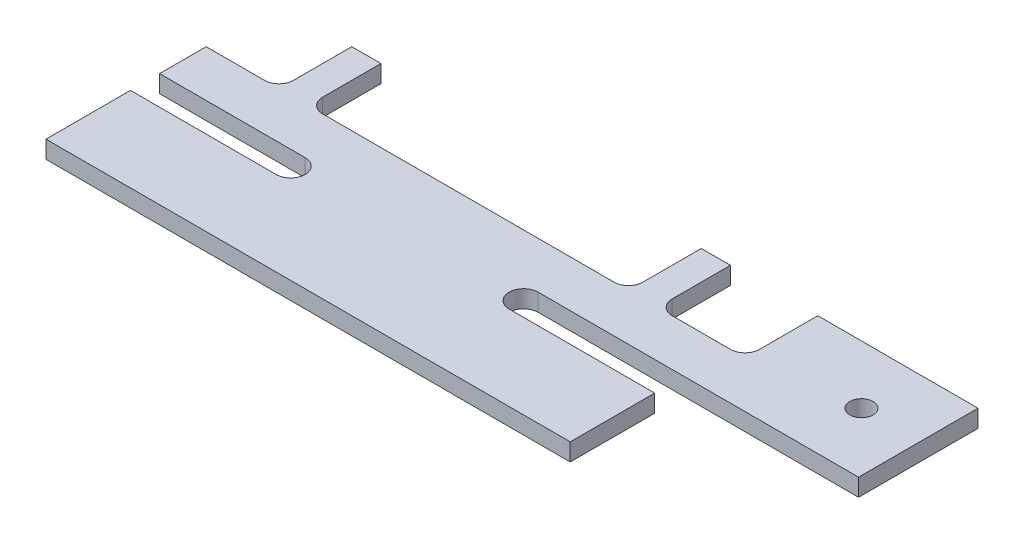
from build123d import *

# Parameters (mm, degrees)
SKETCH1_R      = 2
EXTRUDE1_DEPTH = 3


with BuildPart() as part:
    # Sketch1 → Extrude1 (new body)
    with BuildSketch(Plane(origin=(0, 0, 0), x_dir=(1, 0, 0), z_dir=(0, 1, 0))):
        with BuildLine():
            Line((90, 0), (90, 14.5))
            Line((90, 14.5), (65, 14.5))
            ThreePointArc((65, 14.5), (62.5, 17), (65, 19.5))
            Line((65, 19.5), (120, 19.5))
            Line((120, 19.5), (120, 40))
            Line((120, 40), (92.5, 40))
            Line((92.5, 40), (92.5, 30))
            ThreePointArc((92.5, 30), (91.767766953, 28.232233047), (90, 27.5))
            Line((90, 27.5), (80, 27.5))
            ThreePointArc((80, 27.5), (78.232233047, 28.232233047), (77.5, 30))
            Line((77.5, 30), (77.5, 40))
            Line((77.5, 40), (72.5, 40))
            Line((72.5, 40), (72.5, 30))
            ThreePointArc((72.5, 30), (71.767766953, 28.232233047), (70, 27.5))
            Line((70, 27.5), (20, 27.5))
            ThreePointArc((20, 27.5), (18.232233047, 28.232233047), (17.5, 30))
            Line((17.5, 30), (17.5, 40))
            Line((17.5, 40), (12.5, 40))
            Line((12.5, 40), (12.5, 30))
            ThreePointArc((12.5, 30), (11.767766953, 28.232233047), (10, 27.5))
            Line((10, 27.5), (0, 27.5))
            Line((0, 27.5), (0, 19.5))
            Line((0, 19.5), (25, 19.5))
            ThreePointArc((25, 19.5), (27.5, 17), (25, 14.5))
            Line((25, 14.5), (0, 14.5))
            Line((0, 14.5), (0, 0))
            Line((0, 0), (90, 0))
        make_face()
        with Locations(Location((110, 30, 0), (0, 0, 270))):
            Circle(SKETCH1_R, mode=Mode.SUBTRACT)
    extrude(amount=EXTRUDE1_DEPTH)


solid = part.part
